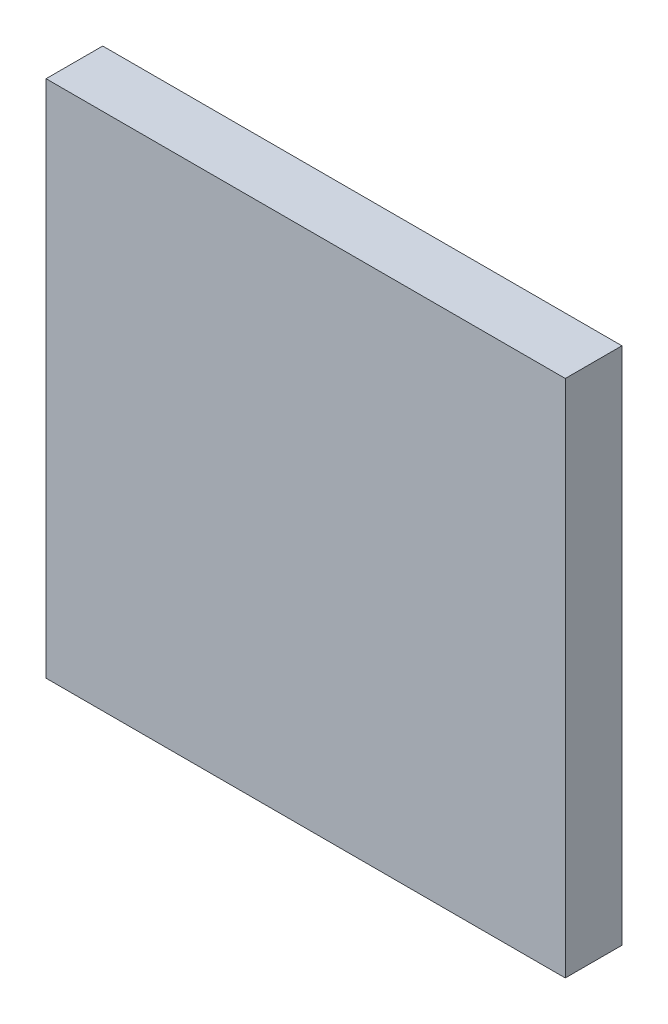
ISO-10303-21;
HEADER;
FILE_DESCRIPTION(('STEP AP214'),'2;1');
FILE_NAME('part.step','',(''),(''),'','','');
FILE_SCHEMA(('AUTOMOTIVE_DESIGN { 1 0 10303 214 1 1 1 1 }'));
ENDSEC;
DATA;
#1=APPLICATION_CONTEXT('core data for automotive mechanical design processes');
#2=APPLICATION_PROTOCOL_DEFINITION('international standard','automotive_design',2000,#1);
#3=PRODUCT_CONTEXT('',#1,'mechanical');
#4=PRODUCT('Part','Part','',(#3));
#5=PRODUCT_RELATED_PRODUCT_CATEGORY('part','',(#4));
#6=PRODUCT_DEFINITION_FORMATION('','',#4);
#7=PRODUCT_DEFINITION_CONTEXT('part definition',#1,'design');
#8=PRODUCT_DEFINITION('design','',#6,#7);
#9=PRODUCT_DEFINITION_SHAPE('','',#8);
#10=(LENGTH_UNIT() NAMED_UNIT(*) SI_UNIT(.MILLI.,.METRE.));
#11=(NAMED_UNIT(*) PLANE_ANGLE_UNIT() SI_UNIT($,.RADIAN.));
#12=(NAMED_UNIT(*) SI_UNIT($,.STERADIAN.) SOLID_ANGLE_UNIT());
#13=UNCERTAINTY_MEASURE_WITH_UNIT(LENGTH_MEASURE(1.E-05),#10,'distance_accuracy_value','');
#14=(GEOMETRIC_REPRESENTATION_CONTEXT(3) GLOBAL_UNCERTAINTY_ASSIGNED_CONTEXT((#13)) GLOBAL_UNIT_ASSIGNED_CONTEXT((#10,
#11,#12)) REPRESENTATION_CONTEXT('',''));
#15=CARTESIAN_POINT('',(0.,0.,0.));
#16=DIRECTION('',(0.,0.,1.));
#17=DIRECTION('',(1.,0.,0.));
#18=AXIS2_PLACEMENT_3D('',#15,#16,#17);
#19=CARTESIAN_POINT('',(0.,-3.05311331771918E-13,12.));
#20=DIRECTION('',(0.999999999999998,0.,0.));
#21=DIRECTION('',(0.,0.,-0.999999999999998));
#22=AXIS2_PLACEMENT_3D('',#19,#20,#21);
#23=PLANE('',#22);
#24=DIRECTION('',(0.,-1.,0.));
#25=VECTOR('',#24,1.);
#26=CARTESIAN_POINT('',(0.,-3.05311331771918E-13,0.));
#27=LINE('',#26,#25);
#28=CARTESIAN_POINT('',(0.,110.,0.));
#29=VERTEX_POINT('',#28);
#30=CARTESIAN_POINT('',(0.,-3.05311331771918E-13,0.));
#31=VERTEX_POINT('',#30);
#32=EDGE_CURVE('E73',#29,#31,#27,.T.);
#33=ORIENTED_EDGE('',*,*,#32,.T.);
#34=DIRECTION('',(0.,0.,-0.999999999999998));
#35=VECTOR('',#34,1.);
#36=CARTESIAN_POINT('',(0.,-3.05311331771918E-13,12.));
#37=LINE('',#36,#35);
#38=CARTESIAN_POINT('',(0.,-3.05311331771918E-13,12.));
#39=VERTEX_POINT('',#38);
#40=EDGE_CURVE('E11',#39,#31,#37,.T.);
#41=ORIENTED_EDGE('',*,*,#40,.F.);
#42=DIRECTION('',(0.,-1.,0.));
#43=VECTOR('',#42,1.);
#44=CARTESIAN_POINT('',(0.,-3.05311331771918E-13,12.));
#45=LINE('',#44,#43);
#46=CARTESIAN_POINT('',(0.,110.,12.));
#47=VERTEX_POINT('',#46);
#48=EDGE_CURVE('E91',#47,#39,#45,.T.);
#49=ORIENTED_EDGE('',*,*,#48,.F.);
#50=DIRECTION('',(0.,0.,-0.999999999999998));
#51=VECTOR('',#50,1.);
#52=CARTESIAN_POINT('',(0.,110.,12.));
#53=LINE('',#52,#51);
#54=EDGE_CURVE('E85',#47,#29,#53,.T.);
#55=ORIENTED_EDGE('',*,*,#54,.T.);
#56=EDGE_LOOP('',(#33,#41,#49,#55));
#57=FACE_BOUND('',#56,.T.);
#58=ADVANCED_FACE('F29',(#57),#23,.F.);
#59=CARTESIAN_POINT('',(0.,-3.05311331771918E-13,12.));
#60=DIRECTION('',(0.,1.,0.));
#61=DIRECTION('',(0.,0.,0.999999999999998));
#62=AXIS2_PLACEMENT_3D('',#59,#60,#61);
#63=PLANE('',#62);
#64=DIRECTION('',(0.999999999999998,0.,0.));
#65=VECTOR('',#64,1.);
#66=CARTESIAN_POINT('',(0.,-3.05311331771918E-13,0.));
#67=LINE('',#66,#65);
#68=CARTESIAN_POINT('',(110.,0.,2.44249065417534E-12));
#69=VERTEX_POINT('',#68);
#70=EDGE_CURVE('E69',#31,#69,#67,.T.);
#71=ORIENTED_EDGE('',*,*,#70,.T.);
#72=DIRECTION('',(0.,0.,-0.999999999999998));
#73=VECTOR('',#72,1.);
#74=CARTESIAN_POINT('',(109.999999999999,0.,12.0000000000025));
#75=LINE('',#74,#73);
#76=CARTESIAN_POINT('',(109.999999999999,0.,12.0000000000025));
#77=VERTEX_POINT('',#76);
#78=EDGE_CURVE('E36',#77,#69,#75,.T.);
#79=ORIENTED_EDGE('',*,*,#78,.F.);
#80=DIRECTION('',(0.999999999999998,0.,0.));
#81=VECTOR('',#80,1.);
#82=CARTESIAN_POINT('',(0.,-3.05311331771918E-13,12.));
#83=LINE('',#82,#81);
#84=EDGE_CURVE('E81',#39,#77,#83,.T.);
#85=ORIENTED_EDGE('',*,*,#84,.F.);
#86=ORIENTED_EDGE('',*,*,#40,.T.);
#87=EDGE_LOOP('',(#71,#79,#85,#86));
#88=FACE_BOUND('',#87,.T.);
#89=ADVANCED_FACE('F80',(#88),#63,.F.);
#90=CARTESIAN_POINT('',(109.999999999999,0.,12.0000000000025));
#91=DIRECTION('',(-0.999999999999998,0.,0.));
#92=DIRECTION('',(0.,0.,0.999999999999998));
#93=AXIS2_PLACEMENT_3D('',#90,#91,#92);
#94=PLANE('',#93);
#95=DIRECTION('',(0.,1.,0.));
#96=VECTOR('',#95,1.);
#97=CARTESIAN_POINT('',(110.,0.,2.44249065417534E-12));
#98=LINE('',#97,#96);
#99=CARTESIAN_POINT('',(109.999999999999,110.,0.));
#100=VERTEX_POINT('',#99);
#101=EDGE_CURVE('E74',#69,#100,#98,.T.);
#102=ORIENTED_EDGE('',*,*,#101,.T.);
#103=DIRECTION('',(0.,0.,-0.999999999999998));
#104=VECTOR('',#103,1.);
#105=CARTESIAN_POINT('',(110.,110.,12.));
#106=LINE('',#105,#104);
#107=CARTESIAN_POINT('',(110.,110.,12.));
#108=VERTEX_POINT('',#107);
#109=EDGE_CURVE('E97',#108,#100,#106,.T.);
#110=ORIENTED_EDGE('',*,*,#109,.F.);
#111=DIRECTION('',(0.,1.,0.));
#112=VECTOR('',#111,1.);
#113=CARTESIAN_POINT('',(109.999999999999,0.,12.0000000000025));
#114=LINE('',#113,#112);
#115=EDGE_CURVE('E48',#77,#108,#114,.T.);
#116=ORIENTED_EDGE('',*,*,#115,.F.);
#117=ORIENTED_EDGE('',*,*,#78,.T.);
#118=EDGE_LOOP('',(#102,#110,#116,#117));
#119=FACE_BOUND('',#118,.T.);
#120=ADVANCED_FACE('F100',(#119),#94,.F.);
#121=CARTESIAN_POINT('',(0.,110.,12.));
#122=DIRECTION('',(0.,-1.,0.));
#123=DIRECTION('',(0.999999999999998,0.,0.));
#124=AXIS2_PLACEMENT_3D('',#121,#122,#123);
#125=PLANE('',#124);
#126=DIRECTION('',(-0.999999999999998,0.,0.));
#127=VECTOR('',#126,1.);
#128=CARTESIAN_POINT('',(0.,110.,0.));
#129=LINE('',#128,#127);
#130=EDGE_CURVE('E89',#100,#29,#129,.T.);
#131=ORIENTED_EDGE('',*,*,#130,.T.);
#132=ORIENTED_EDGE('',*,*,#54,.F.);
#133=DIRECTION('',(-0.999999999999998,0.,0.));
#134=VECTOR('',#133,1.);
#135=CARTESIAN_POINT('',(0.,110.,12.));
#136=LINE('',#135,#134);
#137=EDGE_CURVE('E43',#108,#47,#136,.T.);
#138=ORIENTED_EDGE('',*,*,#137,.F.);
#139=ORIENTED_EDGE('',*,*,#109,.T.);
#140=EDGE_LOOP('',(#131,#132,#138,#139));
#141=FACE_BOUND('',#140,.T.);
#142=ADVANCED_FACE('F102',(#141),#125,.F.);
#143=CARTESIAN_POINT('',(0.,-3.05311331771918E-13,12.));
#144=DIRECTION('',(0.,0.,-0.999999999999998));
#145=DIRECTION('',(-0.999999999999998,0.,0.));
#146=AXIS2_PLACEMENT_3D('',#143,#144,#145);
#147=PLANE('',#146);
#148=ORIENTED_EDGE('',*,*,#48,.T.);
#149=ORIENTED_EDGE('',*,*,#84,.T.);
#150=ORIENTED_EDGE('',*,*,#115,.T.);
#151=ORIENTED_EDGE('',*,*,#137,.T.);
#152=EDGE_LOOP('',(#148,#149,#150,#151));
#153=FACE_BOUND('',#152,.T.);
#154=ADVANCED_FACE('F103',(#153),#147,.F.);
#155=CARTESIAN_POINT('',(0.,-3.05311331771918E-13,0.));
#156=DIRECTION('',(0.,0.,-0.999999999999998));
#157=DIRECTION('',(-0.999999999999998,0.,0.));
#158=AXIS2_PLACEMENT_3D('',#155,#156,#157);
#159=PLANE('',#158);
#160=ORIENTED_EDGE('',*,*,#32,.F.);
#161=ORIENTED_EDGE('',*,*,#130,.F.);
#162=ORIENTED_EDGE('',*,*,#101,.F.);
#163=ORIENTED_EDGE('',*,*,#70,.F.);
#164=EDGE_LOOP('',(#160,#161,#162,#163));
#165=FACE_BOUND('',#164,.T.);
#166=ADVANCED_FACE('F70',(#165),#159,.T.);
#167=CLOSED_SHELL('',(#58,#89,#120,#142,#154,#166));
#168=MANIFOLD_SOLID_BREP('B2',#167);
#169=ADVANCED_BREP_SHAPE_REPRESENTATION('',(#18,#168),#14);
#170=SHAPE_DEFINITION_REPRESENTATION(#9,#169);
ENDSEC;
END-ISO-10303-21;
